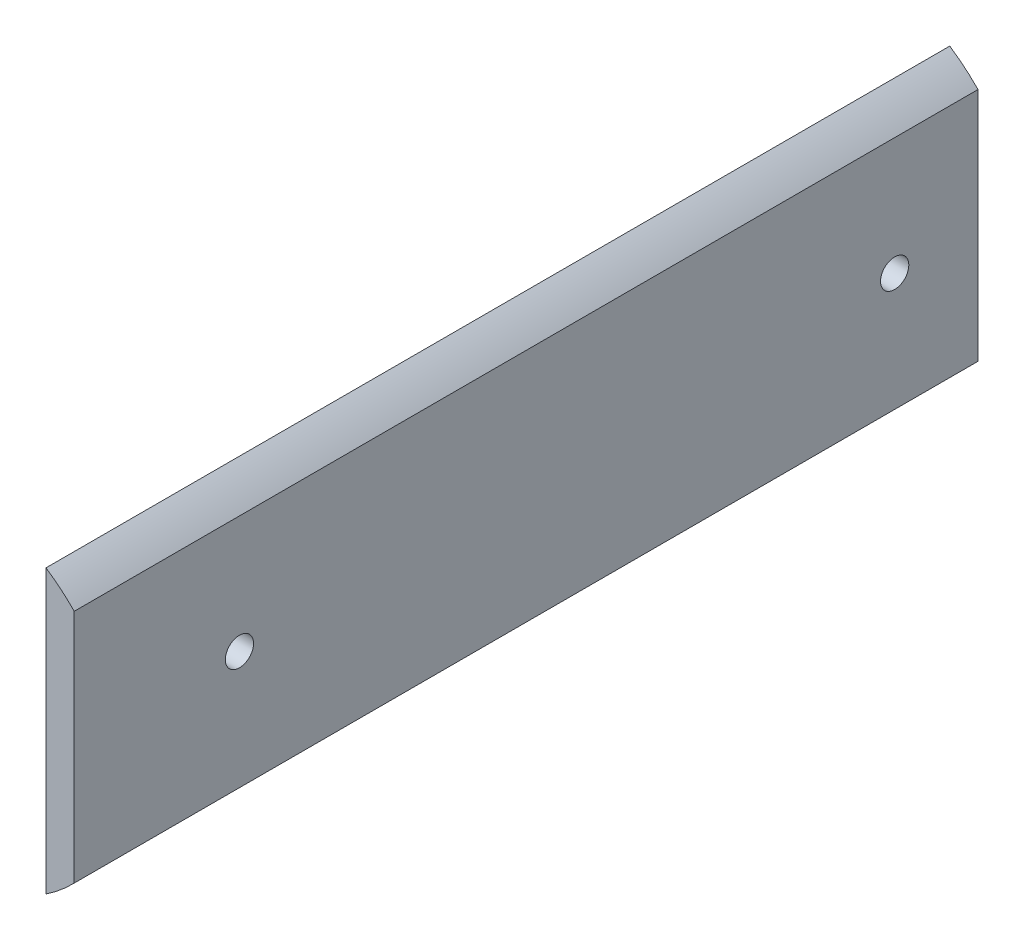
ISO-10303-21;
HEADER;
FILE_DESCRIPTION(('STEP AP214'),'2;1');
FILE_NAME('part.step','',(''),(''),'','','');
FILE_SCHEMA(('AUTOMOTIVE_DESIGN { 1 0 10303 214 1 1 1 1 }'));
ENDSEC;
DATA;
#1=APPLICATION_CONTEXT('core data for automotive mechanical design processes');
#2=APPLICATION_PROTOCOL_DEFINITION('international standard','automotive_design',2000,#1);
#3=PRODUCT_CONTEXT('',#1,'mechanical');
#4=PRODUCT('Part','Part','',(#3));
#5=PRODUCT_RELATED_PRODUCT_CATEGORY('part','',(#4));
#6=PRODUCT_DEFINITION_FORMATION('','',#4);
#7=PRODUCT_DEFINITION_CONTEXT('part definition',#1,'design');
#8=PRODUCT_DEFINITION('design','',#6,#7);
#9=PRODUCT_DEFINITION_SHAPE('','',#8);
#10=(LENGTH_UNIT() NAMED_UNIT(*) SI_UNIT(.MILLI.,.METRE.));
#11=(NAMED_UNIT(*) PLANE_ANGLE_UNIT() SI_UNIT($,.RADIAN.));
#12=(NAMED_UNIT(*) SI_UNIT($,.STERADIAN.) SOLID_ANGLE_UNIT());
#13=UNCERTAINTY_MEASURE_WITH_UNIT(LENGTH_MEASURE(1.E-05),#10,'distance_accuracy_value','');
#14=(GEOMETRIC_REPRESENTATION_CONTEXT(3) GLOBAL_UNCERTAINTY_ASSIGNED_CONTEXT((#13)) GLOBAL_UNIT_ASSIGNED_CONTEXT((#10,
#11,#12)) REPRESENTATION_CONTEXT('',''));
#15=CARTESIAN_POINT('',(0.,0.,0.));
#16=DIRECTION('',(0.,0.,1.));
#17=DIRECTION('',(1.,0.,0.));
#18=AXIS2_PLACEMENT_3D('',#15,#16,#17);
#19=CARTESIAN_POINT('',(-8.01603840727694,-13.3079166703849,158.797952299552));
#20=DIRECTION('',(0.,0.,-1.));
#21=DIRECTION('',(0.,1.,0.));
#22=AXIS2_PLACEMENT_3D('',#19,#20,#21);
#23=CYLINDRICAL_SURFACE('',#22,19.05);
#24=CARTESIAN_POINT('',(-8.01603840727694,-13.3079166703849,158.797952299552));
#25=DIRECTION('',(0.,0.,1.));
#26=DIRECTION('',(0.,-1.,0.));
#27=AXIS2_PLACEMENT_3D('',#24,#25,#26);
#28=CIRCLE('',#27,19.05);
#29=CARTESIAN_POINT('',(2.51424530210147,-29.1829166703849,158.797952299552));
#30=VERTEX_POINT('',#29);
#31=CARTESIAN_POINT('',(5.68924530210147,-26.5392317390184,158.797952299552));
#32=VERTEX_POINT('',#31);
#33=EDGE_CURVE('E39',#30,#32,#28,.T.);
#34=ORIENTED_EDGE('',*,*,#33,.F.);
#35=DIRECTION('',(0.,0.,1.));
#36=VECTOR('',#35,1.);
#37=CARTESIAN_POINT('',(2.51424530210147,-29.1829166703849,57.1979522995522));
#38=LINE('',#37,#36);
#39=CARTESIAN_POINT('',(2.51424530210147,-29.1829166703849,57.1979522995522));
#40=VERTEX_POINT('',#39);
#41=EDGE_CURVE('E71',#40,#30,#38,.T.);
#42=ORIENTED_EDGE('',*,*,#41,.F.);
#43=CARTESIAN_POINT('',(-8.01603840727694,-13.3079166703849,57.1979522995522));
#44=DIRECTION('',(0.,0.,1.));
#45=DIRECTION('',(0.,-1.,0.));
#46=AXIS2_PLACEMENT_3D('',#43,#44,#45);
#47=CIRCLE('',#46,19.05);
#48=CARTESIAN_POINT('',(5.68924530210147,-26.5392317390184,57.1979522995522));
#49=VERTEX_POINT('',#48);
#50=EDGE_CURVE('E54',#40,#49,#47,.T.);
#51=ORIENTED_EDGE('',*,*,#50,.T.);
#52=DIRECTION('',(0.,0.,1.));
#53=VECTOR('',#52,1.);
#54=CARTESIAN_POINT('',(5.68924530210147,-26.5392317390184,57.1979522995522));
#55=LINE('',#54,#53);
#56=EDGE_CURVE('E85',#49,#32,#55,.T.);
#57=ORIENTED_EDGE('',*,*,#56,.T.);
#58=EDGE_LOOP('',(#34,#42,#51,#57));
#59=FACE_BOUND('',#58,.T.);
#60=ADVANCED_FACE('F30',(#59),#23,.T.);
#61=CARTESIAN_POINT('',(5.68924530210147,-0.0766016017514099,57.1979522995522));
#62=VERTEX_POINT('',#61);
#63=CARTESIAN_POINT('',(2.51424530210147,2.56708332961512,57.1979522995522));
#64=VERTEX_POINT('',#63);
#65=EDGE_CURVE('E86',#62,#64,#47,.T.);
#66=ORIENTED_EDGE('',*,*,#65,.T.);
#67=DIRECTION('',(0.,0.,1.));
#68=VECTOR('',#67,1.);
#69=CARTESIAN_POINT('',(2.51424530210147,2.56708332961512,57.1979522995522));
#70=LINE('',#69,#68);
#71=CARTESIAN_POINT('',(2.51424530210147,2.56708332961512,158.797952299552));
#72=VERTEX_POINT('',#71);
#73=EDGE_CURVE('E46',#64,#72,#70,.T.);
#74=ORIENTED_EDGE('',*,*,#73,.T.);
#75=CARTESIAN_POINT('',(5.68924530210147,-0.0766016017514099,158.797952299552));
#76=VERTEX_POINT('',#75);
#77=EDGE_CURVE('E11',#76,#72,#28,.T.);
#78=ORIENTED_EDGE('',*,*,#77,.F.);
#79=DIRECTION('',(0.,0.,1.));
#80=VECTOR('',#79,1.);
#81=CARTESIAN_POINT('',(5.68924530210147,-0.0766016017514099,57.1979522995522));
#82=LINE('',#81,#80);
#83=EDGE_CURVE('E90',#62,#76,#82,.T.);
#84=ORIENTED_EDGE('',*,*,#83,.F.);
#85=EDGE_LOOP('',(#66,#74,#78,#84));
#86=FACE_BOUND('',#85,.T.);
#87=ADVANCED_FACE('F32',(#86),#23,.T.);
#88=CARTESIAN_POINT('',(-8.01603840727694,-13.3079166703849,158.797952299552));
#89=DIRECTION('',(0.,0.,1.));
#90=DIRECTION('',(0.,-1.,0.));
#91=AXIS2_PLACEMENT_3D('',#88,#89,#90);
#92=PLANE('',#91);
#93=DIRECTION('',(0.,1.,0.));
#94=VECTOR('',#93,1.);
#95=CARTESIAN_POINT('',(2.51424530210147,2.56708332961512,158.797952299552));
#96=LINE('',#95,#94);
#97=EDGE_CURVE('E74',#30,#72,#96,.T.);
#98=ORIENTED_EDGE('',*,*,#97,.F.);
#99=ORIENTED_EDGE('',*,*,#33,.T.);
#100=DIRECTION('',(0.,-1.,0.));
#101=VECTOR('',#100,1.);
#102=CARTESIAN_POINT('',(5.68924530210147,-0.0766016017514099,158.797952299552));
#103=LINE('',#102,#101);
#104=EDGE_CURVE('E96',#76,#32,#103,.T.);
#105=ORIENTED_EDGE('',*,*,#104,.F.);
#106=ORIENTED_EDGE('',*,*,#77,.T.);
#107=EDGE_LOOP('',(#98,#99,#105,#106));
#108=FACE_BOUND('',#107,.T.);
#109=ADVANCED_FACE('F79',(#108),#92,.T.);
#110=CARTESIAN_POINT('',(-8.01603840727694,-13.3079166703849,57.1979522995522));
#111=DIRECTION('',(0.,0.,1.));
#112=DIRECTION('',(0.,-1.,0.));
#113=AXIS2_PLACEMENT_3D('',#110,#111,#112);
#114=PLANE('',#113);
#115=ORIENTED_EDGE('',*,*,#50,.F.);
#116=DIRECTION('',(0.,1.,0.));
#117=VECTOR('',#116,1.);
#118=CARTESIAN_POINT('',(2.51424530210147,2.56708332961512,57.1979522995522));
#119=LINE('',#118,#117);
#120=EDGE_CURVE('E75',#40,#64,#119,.T.);
#121=ORIENTED_EDGE('',*,*,#120,.T.);
#122=ORIENTED_EDGE('',*,*,#65,.F.);
#123=DIRECTION('',(0.,-1.,0.));
#124=VECTOR('',#123,1.);
#125=CARTESIAN_POINT('',(5.68924530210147,-0.0766016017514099,57.1979522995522));
#126=LINE('',#125,#124);
#127=EDGE_CURVE('E92',#62,#49,#126,.T.);
#128=ORIENTED_EDGE('',*,*,#127,.T.);
#129=EDGE_LOOP('',(#115,#121,#122,#128));
#130=FACE_BOUND('',#129,.T.);
#131=ADVANCED_FACE('F132',(#130),#114,.F.);
#132=CARTESIAN_POINT('',(5.68924530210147,-0.0766016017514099,57.1979522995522));
#133=DIRECTION('',(-1.,0.,0.));
#134=DIRECTION('',(0.,0.,-1.));
#135=AXIS2_PLACEMENT_3D('',#132,#133,#134);
#136=PLANE('',#135);
#137=CARTESIAN_POINT('',(5.68924530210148,-13.2782646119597,140.226378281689));
#138=DIRECTION('',(-1.,0.,0.));
#139=DIRECTION('',(0.,-1.,0.));
#140=AXIS2_PLACEMENT_3D('',#137,#138,#139);
#141=CIRCLE('',#140,1.58749999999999);
#142=CARTESIAN_POINT('',(5.68924530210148,-14.8657646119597,140.226378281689));
#143=VERTEX_POINT('',#142);
#144=EDGE_CURVE('E34',#143,#143,#141,.T.);
#145=ORIENTED_EDGE('',*,*,#144,.T.);
#146=EDGE_LOOP('',(#145));
#147=FACE_BOUND('',#146,.T.);
#148=CARTESIAN_POINT('',(5.68924530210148,-13.2782646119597,66.566378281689));
#149=DIRECTION('',(-1.,0.,0.));
#150=DIRECTION('',(0.,-1.,0.));
#151=AXIS2_PLACEMENT_3D('',#148,#149,#150);
#152=CIRCLE('',#151,1.58749999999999);
#153=CARTESIAN_POINT('',(5.68924530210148,-14.8657646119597,66.566378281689));
#154=VERTEX_POINT('',#153);
#155=EDGE_CURVE('E83',#154,#154,#152,.T.);
#156=ORIENTED_EDGE('',*,*,#155,.T.);
#157=EDGE_LOOP('',(#156));
#158=FACE_BOUND('',#157,.T.);
#159=ORIENTED_EDGE('',*,*,#104,.T.);
#160=ORIENTED_EDGE('',*,*,#56,.F.);
#161=ORIENTED_EDGE('',*,*,#127,.F.);
#162=ORIENTED_EDGE('',*,*,#83,.T.);
#163=EDGE_LOOP('',(#159,#160,#161,#162));
#164=FACE_BOUND('',#163,.T.);
#165=ADVANCED_FACE('F112',(#147,#158,#164),#136,.F.);
#166=CARTESIAN_POINT('',(2.51424530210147,2.56708332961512,57.1979522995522));
#167=DIRECTION('',(1.,0.,0.));
#168=DIRECTION('',(0.,0.,1.));
#169=AXIS2_PLACEMENT_3D('',#166,#167,#168);
#170=PLANE('',#169);
#171=CARTESIAN_POINT('',(2.51424530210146,-13.2782646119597,140.226378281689));
#172=DIRECTION('',(-1.,0.,0.));
#173=DIRECTION('',(0.,0.,1.));
#174=AXIS2_PLACEMENT_3D('',#171,#172,#173);
#175=CIRCLE('',#174,1.58749999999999);
#176=CARTESIAN_POINT('',(2.51424530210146,-13.2782646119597,141.813878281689));
#177=VERTEX_POINT('',#176);
#178=EDGE_CURVE('E105',#177,#177,#175,.T.);
#179=ORIENTED_EDGE('',*,*,#178,.F.);
#180=EDGE_LOOP('',(#179));
#181=FACE_BOUND('',#180,.T.);
#182=CARTESIAN_POINT('',(2.51424530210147,-13.2782646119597,66.566378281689));
#183=DIRECTION('',(-1.,0.,0.));
#184=DIRECTION('',(0.,0.,1.));
#185=AXIS2_PLACEMENT_3D('',#182,#183,#184);
#186=CIRCLE('',#185,1.58749999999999);
#187=CARTESIAN_POINT('',(2.51424530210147,-13.2782646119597,68.153878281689));
#188=VERTEX_POINT('',#187);
#189=EDGE_CURVE('E102',#188,#188,#186,.T.);
#190=ORIENTED_EDGE('',*,*,#189,.F.);
#191=EDGE_LOOP('',(#190));
#192=FACE_BOUND('',#191,.T.);
#193=ORIENTED_EDGE('',*,*,#97,.T.);
#194=ORIENTED_EDGE('',*,*,#73,.F.);
#195=ORIENTED_EDGE('',*,*,#120,.F.);
#196=ORIENTED_EDGE('',*,*,#41,.T.);
#197=EDGE_LOOP('',(#193,#194,#195,#196));
#198=FACE_BOUND('',#197,.T.);
#199=ADVANCED_FACE('F73',(#181,#192,#198),#170,.F.);
#200=CARTESIAN_POINT('',(2.51424530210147,-13.2782646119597,66.566378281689));
#201=DIRECTION('',(-1.,0.,0.));
#202=DIRECTION('',(0.,0.,1.));
#203=AXIS2_PLACEMENT_3D('',#200,#201,#202);
#204=CYLINDRICAL_SURFACE('',#203,1.58749999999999);
#205=ORIENTED_EDGE('',*,*,#189,.T.);
#206=EDGE_LOOP('',(#205));
#207=FACE_BOUND('',#206,.T.);
#208=ORIENTED_EDGE('',*,*,#155,.F.);
#209=EDGE_LOOP('',(#208));
#210=FACE_BOUND('',#209,.T.);
#211=ADVANCED_FACE('F117',(#207,#210),#204,.F.);
#212=CARTESIAN_POINT('',(2.51424530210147,-13.2782646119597,140.226378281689));
#213=DIRECTION('',(-1.,0.,0.));
#214=DIRECTION('',(0.,0.,1.));
#215=AXIS2_PLACEMENT_3D('',#212,#213,#214);
#216=CYLINDRICAL_SURFACE('',#215,1.58749999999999);
#217=ORIENTED_EDGE('',*,*,#178,.T.);
#218=EDGE_LOOP('',(#217));
#219=FACE_BOUND('',#218,.T.);
#220=ORIENTED_EDGE('',*,*,#144,.F.);
#221=EDGE_LOOP('',(#220));
#222=FACE_BOUND('',#221,.T.);
#223=ADVANCED_FACE('F115',(#219,#222),#216,.F.);
#224=CLOSED_SHELL('',(#60,#87,#109,#131,#165,#199,#211,#223));
#225=MANIFOLD_SOLID_BREP('B2',#224);
#226=ADVANCED_BREP_SHAPE_REPRESENTATION('',(#18,#225),#14);
#227=SHAPE_DEFINITION_REPRESENTATION(#9,#226);
ENDSEC;
END-ISO-10303-21;
